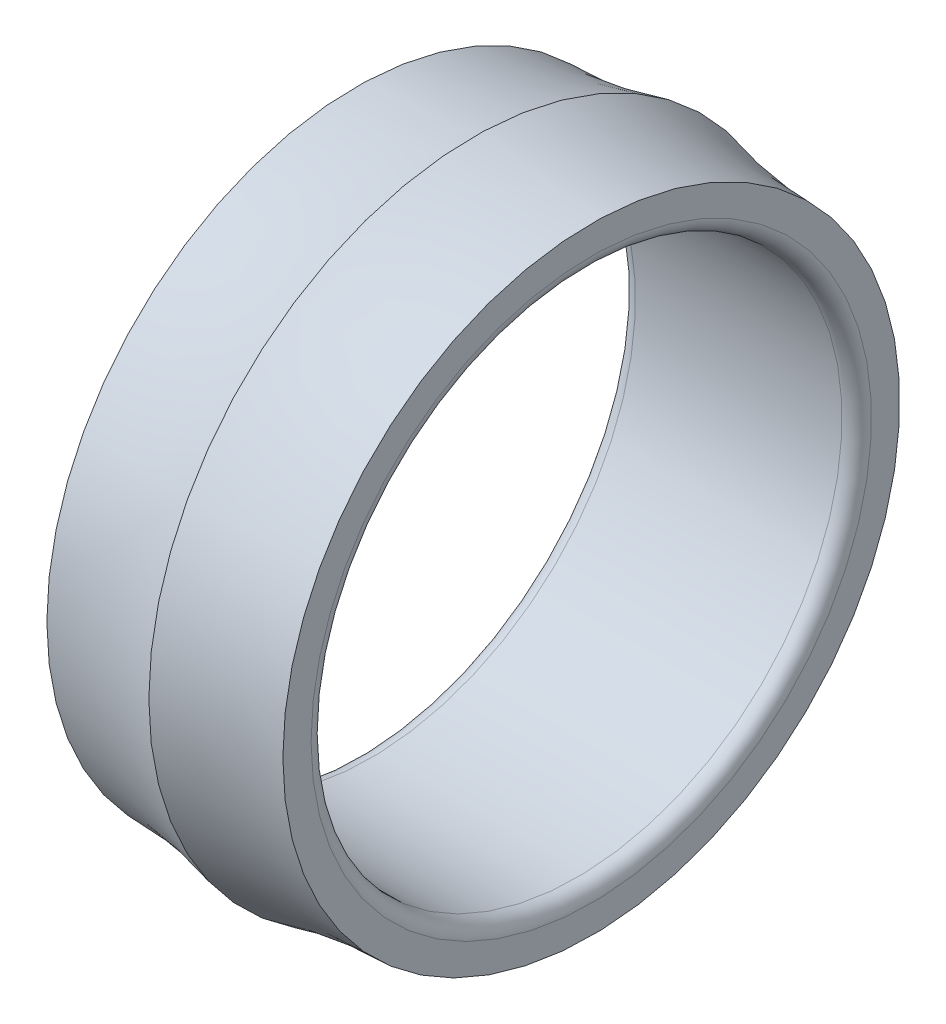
ISO-10303-21;
HEADER;
FILE_DESCRIPTION(('STEP AP214'),'2;1');
FILE_NAME('part.step','',(''),(''),'','','');
FILE_SCHEMA(('AUTOMOTIVE_DESIGN { 1 0 10303 214 1 1 1 1 }'));
ENDSEC;
DATA;
#1=APPLICATION_CONTEXT('core data for automotive mechanical design processes');
#2=APPLICATION_PROTOCOL_DEFINITION('international standard','automotive_design',2000,#1);
#3=PRODUCT_CONTEXT('',#1,'mechanical');
#4=PRODUCT('Part','Part','',(#3));
#5=PRODUCT_RELATED_PRODUCT_CATEGORY('part','',(#4));
#6=PRODUCT_DEFINITION_FORMATION('','',#4);
#7=PRODUCT_DEFINITION_CONTEXT('part definition',#1,'design');
#8=PRODUCT_DEFINITION('design','',#6,#7);
#9=PRODUCT_DEFINITION_SHAPE('','',#8);
#10=(LENGTH_UNIT() NAMED_UNIT(*) SI_UNIT(.MILLI.,.METRE.));
#11=(NAMED_UNIT(*) PLANE_ANGLE_UNIT() SI_UNIT($,.RADIAN.));
#12=(NAMED_UNIT(*) SI_UNIT($,.STERADIAN.) SOLID_ANGLE_UNIT());
#13=UNCERTAINTY_MEASURE_WITH_UNIT(LENGTH_MEASURE(1.E-05),#10,'distance_accuracy_value','');
#14=(GEOMETRIC_REPRESENTATION_CONTEXT(3) GLOBAL_UNCERTAINTY_ASSIGNED_CONTEXT((#13)) GLOBAL_UNIT_ASSIGNED_CONTEXT((#10,
#11,#12)) REPRESENTATION_CONTEXT('',''));
#15=CARTESIAN_POINT('',(0.,0.,0.));
#16=DIRECTION('',(0.,0.,1.));
#17=DIRECTION('',(1.,0.,0.));
#18=AXIS2_PLACEMENT_3D('',#15,#16,#17);
#19=CARTESIAN_POINT('',(0.,0.,0.));
#20=DIRECTION('',(-1.,0.,0.));
#21=DIRECTION('',(0.,0.,1.));
#22=AXIS2_PLACEMENT_3D('',#19,#20,#21);
#23=TOROIDAL_SURFACE('',#22,127.284161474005,75.);
#24=CARTESIAN_POINT('',(0.,0.,0.));
#25=DIRECTION('',(-1.,0.,0.));
#26=DIRECTION('',(0.,0.,1.));
#27=AXIS2_PLACEMENT_3D('',#24,#25,#26);
#28=CIRCLE('',#27,52.2841614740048);
#29=CARTESIAN_POINT('',(0.,0.,52.2841614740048));
#30=VERTEX_POINT('',#29);
#31=EDGE_CURVE('E10',#30,#30,#28,.T.);
#32=ORIENTED_EDGE('',*,*,#31,.F.);
#33=EDGE_LOOP('',(#32));
#34=FACE_BOUND('',#33,.T.);
#35=CARTESIAN_POINT('',(20.,0.,0.));
#36=DIRECTION('',(-1.,0.,0.));
#37=DIRECTION('',(0.,0.,1.));
#38=AXIS2_PLACEMENT_3D('',#35,#36,#37);
#39=CIRCLE('',#38,55.);
#40=CARTESIAN_POINT('',(20.,0.,55.));
#41=VERTEX_POINT('',#40);
#42=EDGE_CURVE('E54',#41,#41,#39,.T.);
#43=ORIENTED_EDGE('',*,*,#42,.T.);
#44=EDGE_LOOP('',(#43));
#45=FACE_BOUND('',#44,.T.);
#46=ADVANCED_FACE('F29',(#34,#45),#23,.F.);
#47=CARTESIAN_POINT('',(0.,0.,-47.5));
#48=DIRECTION('',(1.,0.,0.));
#49=DIRECTION('',(0.,0.,-1.));
#50=AXIS2_PLACEMENT_3D('',#47,#48,#49);
#51=PLANE('',#50);
#52=CARTESIAN_POINT('',(0.,0.,0.));
#53=DIRECTION('',(-1.,0.,0.));
#54=DIRECTION('',(0.,0.,1.));
#55=AXIS2_PLACEMENT_3D('',#52,#53,#54);
#56=CIRCLE('',#55,47.5);
#57=CARTESIAN_POINT('',(0.,0.,47.5));
#58=VERTEX_POINT('',#57);
#59=EDGE_CURVE('E35',#58,#58,#56,.T.);
#60=ORIENTED_EDGE('',*,*,#59,.F.);
#61=EDGE_LOOP('',(#60));
#62=FACE_BOUND('',#61,.T.);
#63=ORIENTED_EDGE('',*,*,#31,.T.);
#64=EDGE_LOOP('',(#63));
#65=FACE_BOUND('',#64,.T.);
#66=ADVANCED_FACE('F85',(#62,#65),#51,.F.);
#67=CARTESIAN_POINT('',(2.5,0.,0.));
#68=DIRECTION('',(-1.,0.,0.));
#69=DIRECTION('',(0.,0.,1.));
#70=AXIS2_PLACEMENT_3D('',#67,#68,#69);
#71=TOROIDAL_SURFACE('',#70,47.5,2.5);
#72=CARTESIAN_POINT('',(2.5,0.,0.));
#73=DIRECTION('',(-1.,0.,0.));
#74=DIRECTION('',(0.,0.,1.));
#75=AXIS2_PLACEMENT_3D('',#72,#73,#74);
#76=CIRCLE('',#75,45.);
#77=CARTESIAN_POINT('',(2.5,0.,45.));
#78=VERTEX_POINT('',#77);
#79=EDGE_CURVE('E39',#78,#78,#76,.T.);
#80=ORIENTED_EDGE('',*,*,#79,.F.);
#81=EDGE_LOOP('',(#80));
#82=FACE_BOUND('',#81,.T.);
#83=ORIENTED_EDGE('',*,*,#59,.T.);
#84=EDGE_LOOP('',(#83));
#85=FACE_BOUND('',#84,.T.);
#86=ADVANCED_FACE('F80',(#82,#85),#71,.T.);
#87=CARTESIAN_POINT('',(0.,0.,0.));
#88=DIRECTION('',(-1.,0.,0.));
#89=DIRECTION('',(0.,0.,1.));
#90=AXIS2_PLACEMENT_3D('',#87,#88,#89);
#91=CYLINDRICAL_SURFACE('',#90,45.);
#92=CARTESIAN_POINT('',(37.5,0.,0.));
#93=DIRECTION('',(-1.,0.,0.));
#94=DIRECTION('',(0.,0.,1.));
#95=AXIS2_PLACEMENT_3D('',#92,#93,#94);
#96=CIRCLE('',#95,45.);
#97=CARTESIAN_POINT('',(37.5,0.,45.));
#98=VERTEX_POINT('',#97);
#99=EDGE_CURVE('E43',#98,#98,#96,.T.);
#100=ORIENTED_EDGE('',*,*,#99,.F.);
#101=EDGE_LOOP('',(#100));
#102=FACE_BOUND('',#101,.T.);
#103=ORIENTED_EDGE('',*,*,#79,.T.);
#104=EDGE_LOOP('',(#103));
#105=FACE_BOUND('',#104,.T.);
#106=ADVANCED_FACE('F74',(#102,#105),#91,.F.);
#107=CARTESIAN_POINT('',(37.5,0.,0.));
#108=DIRECTION('',(-1.,0.,0.));
#109=DIRECTION('',(0.,0.,1.));
#110=AXIS2_PLACEMENT_3D('',#107,#108,#109);
#111=TOROIDAL_SURFACE('',#110,47.5,2.5);
#112=CARTESIAN_POINT('',(40.,0.,0.));
#113=DIRECTION('',(-1.,0.,0.));
#114=DIRECTION('',(0.,0.,1.));
#115=AXIS2_PLACEMENT_3D('',#112,#113,#114);
#116=CIRCLE('',#115,47.5);
#117=CARTESIAN_POINT('',(40.,0.,47.5));
#118=VERTEX_POINT('',#117);
#119=EDGE_CURVE('E48',#118,#118,#116,.T.);
#120=ORIENTED_EDGE('',*,*,#119,.F.);
#121=EDGE_LOOP('',(#120));
#122=FACE_BOUND('',#121,.T.);
#123=ORIENTED_EDGE('',*,*,#99,.T.);
#124=EDGE_LOOP('',(#123));
#125=FACE_BOUND('',#124,.T.);
#126=ADVANCED_FACE('F68',(#122,#125),#111,.T.);
#127=CARTESIAN_POINT('',(40.,0.,-47.5));
#128=DIRECTION('',(-1.,0.,0.));
#129=DIRECTION('',(0.,0.,1.));
#130=AXIS2_PLACEMENT_3D('',#127,#128,#129);
#131=PLANE('',#130);
#132=CARTESIAN_POINT('',(40.,0.,0.));
#133=DIRECTION('',(-1.,0.,0.));
#134=DIRECTION('',(0.,0.,1.));
#135=AXIS2_PLACEMENT_3D('',#132,#133,#134);
#136=CIRCLE('',#135,52.2841614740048);
#137=CARTESIAN_POINT('',(40.,0.,52.2841614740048));
#138=VERTEX_POINT('',#137);
#139=EDGE_CURVE('E51',#138,#138,#136,.T.);
#140=ORIENTED_EDGE('',*,*,#139,.F.);
#141=EDGE_LOOP('',(#140));
#142=FACE_BOUND('',#141,.T.);
#143=ORIENTED_EDGE('',*,*,#119,.T.);
#144=EDGE_LOOP('',(#143));
#145=FACE_BOUND('',#144,.T.);
#146=ADVANCED_FACE('F62',(#142,#145),#131,.F.);
#147=CARTESIAN_POINT('',(40.,0.,0.));
#148=DIRECTION('',(-1.,0.,0.));
#149=DIRECTION('',(0.,0.,1.));
#150=AXIS2_PLACEMENT_3D('',#147,#148,#149);
#151=TOROIDAL_SURFACE('',#150,127.284161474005,75.);
#152=ORIENTED_EDGE('',*,*,#42,.F.);
#153=EDGE_LOOP('',(#152));
#154=FACE_BOUND('',#153,.T.);
#155=ORIENTED_EDGE('',*,*,#139,.T.);
#156=EDGE_LOOP('',(#155));
#157=FACE_BOUND('',#156,.T.);
#158=ADVANCED_FACE('F59',(#154,#157),#151,.F.);
#159=CLOSED_SHELL('',(#46,#66,#86,#106,#126,#146,#158));
#160=MANIFOLD_SOLID_BREP('B2',#159);
#161=ADVANCED_BREP_SHAPE_REPRESENTATION('',(#18,#160),#14);
#162=SHAPE_DEFINITION_REPRESENTATION(#9,#161);
ENDSEC;
END-ISO-10303-21;
